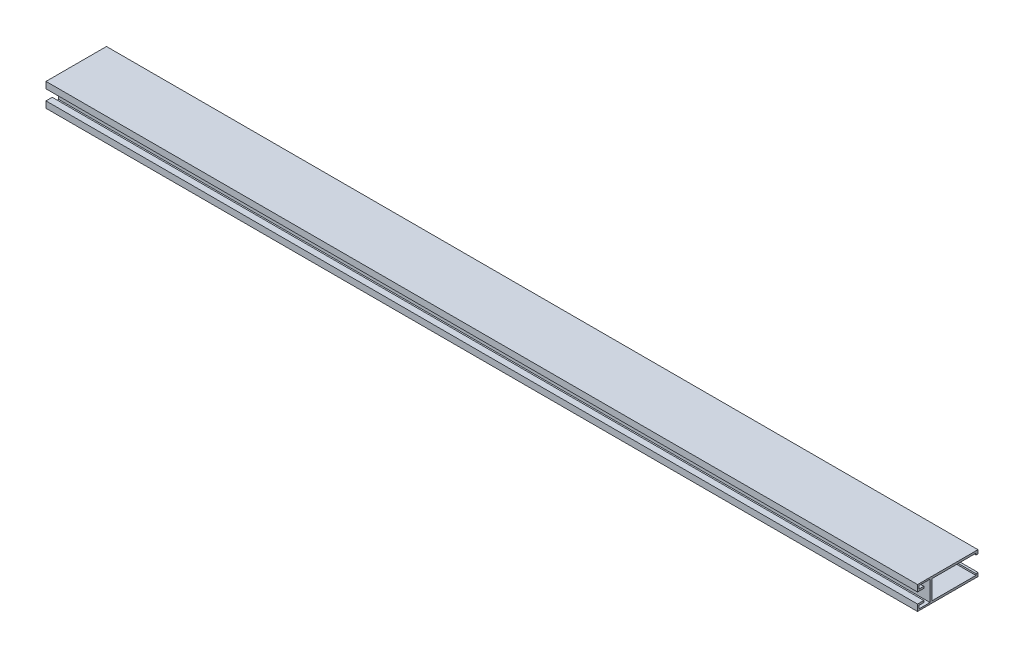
ISO-10303-21;
HEADER;
FILE_DESCRIPTION(('STEP AP214'),'2;1');
FILE_NAME('part.step','',(''),(''),'','','');
FILE_SCHEMA(('AUTOMOTIVE_DESIGN { 1 0 10303 214 1 1 1 1 }'));
ENDSEC;
DATA;
#1=APPLICATION_CONTEXT('core data for automotive mechanical design processes');
#2=APPLICATION_PROTOCOL_DEFINITION('international standard','automotive_design',2000,#1);
#3=PRODUCT_CONTEXT('',#1,'mechanical');
#4=PRODUCT('Part','Part','',(#3));
#5=PRODUCT_RELATED_PRODUCT_CATEGORY('part','',(#4));
#6=PRODUCT_DEFINITION_FORMATION('','',#4);
#7=PRODUCT_DEFINITION_CONTEXT('part definition',#1,'design');
#8=PRODUCT_DEFINITION('design','',#6,#7);
#9=PRODUCT_DEFINITION_SHAPE('','',#8);
#10=(LENGTH_UNIT() NAMED_UNIT(*) SI_UNIT(.MILLI.,.METRE.));
#11=(NAMED_UNIT(*) PLANE_ANGLE_UNIT() SI_UNIT($,.RADIAN.));
#12=(NAMED_UNIT(*) SI_UNIT($,.STERADIAN.) SOLID_ANGLE_UNIT());
#13=UNCERTAINTY_MEASURE_WITH_UNIT(LENGTH_MEASURE(1.E-05),#10,'distance_accuracy_value','');
#14=(GEOMETRIC_REPRESENTATION_CONTEXT(3) GLOBAL_UNCERTAINTY_ASSIGNED_CONTEXT((#13)) GLOBAL_UNIT_ASSIGNED_CONTEXT((#10,
#11,#12)) REPRESENTATION_CONTEXT('',''));
#15=CARTESIAN_POINT('',(0.,0.,0.));
#16=DIRECTION('',(0.,0.,1.));
#17=DIRECTION('',(1.,0.,0.));
#18=AXIS2_PLACEMENT_3D('',#15,#16,#17);
#19=CARTESIAN_POINT('',(903.,-11.55,14.));
#20=DIRECTION('',(0.,0.,1.));
#21=DIRECTION('',(1.,0.,0.));
#22=AXIS2_PLACEMENT_3D('',#19,#20,#21);
#23=PLANE('',#22);
#24=DIRECTION('',(0.,1.,0.));
#25=VECTOR('',#24,1.);
#26=CARTESIAN_POINT('',(903.,-11.55,14.));
#27=LINE('',#26,#25);
#28=CARTESIAN_POINT('',(903.,-10.8,14.));
#29=VERTEX_POINT('',#28);
#30=CARTESIAN_POINT('',(903.,-12.3,14.));
#31=VERTEX_POINT('',#30);
#32=EDGE_CURVE('E260',#29,#31,#27,.F.);
#33=ORIENTED_EDGE('',*,*,#32,.T.);
#34=DIRECTION('',(1.,0.,0.));
#35=VECTOR('',#34,1.);
#36=CARTESIAN_POINT('',(903.,-12.3,14.));
#37=LINE('',#36,#35);
#38=CARTESIAN_POINT('',(1739.,-12.3,14.));
#39=VERTEX_POINT('',#38);
#40=EDGE_CURVE('E252',#39,#31,#37,.F.);
#41=ORIENTED_EDGE('',*,*,#40,.F.);
#42=DIRECTION('',(0.,1.,0.));
#43=VECTOR('',#42,1.);
#44=CARTESIAN_POINT('',(1739.,-11.55,14.));
#45=LINE('',#44,#43);
#46=CARTESIAN_POINT('',(1739.,-10.8,14.));
#47=VERTEX_POINT('',#46);
#48=EDGE_CURVE('E20',#39,#47,#45,.T.);
#49=ORIENTED_EDGE('',*,*,#48,.T.);
#50=DIRECTION('',(1.,0.,0.));
#51=VECTOR('',#50,1.);
#52=CARTESIAN_POINT('',(903.,-10.8,14.));
#53=LINE('',#52,#51);
#54=EDGE_CURVE('E255',#29,#47,#53,.T.);
#55=ORIENTED_EDGE('',*,*,#54,.F.);
#56=EDGE_LOOP('',(#33,#41,#49,#55));
#57=FACE_BOUND('',#56,.T.);
#58=ADVANCED_FACE('F17',(#57),#23,.T.);
#59=CARTESIAN_POINT('',(903.,-28.45,14.));
#60=DIRECTION('',(0.,0.,1.));
#61=DIRECTION('',(1.,0.,0.));
#62=AXIS2_PLACEMENT_3D('',#59,#60,#61);
#63=PLANE('',#62);
#64=DIRECTION('',(0.,1.,0.));
#65=VECTOR('',#64,1.);
#66=CARTESIAN_POINT('',(903.,-28.45,14.));
#67=LINE('',#66,#65);
#68=CARTESIAN_POINT('',(903.,-27.7,14.));
#69=VERTEX_POINT('',#68);
#70=CARTESIAN_POINT('',(903.,-29.2,14.));
#71=VERTEX_POINT('',#70);
#72=EDGE_CURVE('E258',#69,#71,#67,.F.);
#73=ORIENTED_EDGE('',*,*,#72,.T.);
#74=DIRECTION('',(1.,0.,0.));
#75=VECTOR('',#74,1.);
#76=CARTESIAN_POINT('',(903.,-29.2,14.));
#77=LINE('',#76,#75);
#78=CARTESIAN_POINT('',(1739.,-29.2,14.));
#79=VERTEX_POINT('',#78);
#80=EDGE_CURVE('E192',#79,#71,#77,.F.);
#81=ORIENTED_EDGE('',*,*,#80,.F.);
#82=DIRECTION('',(0.,1.,0.));
#83=VECTOR('',#82,1.);
#84=CARTESIAN_POINT('',(1739.,-28.45,14.));
#85=LINE('',#84,#83);
#86=CARTESIAN_POINT('',(1739.,-27.7,14.));
#87=VERTEX_POINT('',#86);
#88=EDGE_CURVE('E175',#79,#87,#85,.T.);
#89=ORIENTED_EDGE('',*,*,#88,.T.);
#90=DIRECTION('',(1.,0.,0.));
#91=VECTOR('',#90,1.);
#92=CARTESIAN_POINT('',(903.,-27.7,14.));
#93=LINE('',#92,#91);
#94=EDGE_CURVE('E202',#69,#87,#93,.T.);
#95=ORIENTED_EDGE('',*,*,#94,.F.);
#96=EDGE_LOOP('',(#73,#81,#89,#95));
#97=FACE_BOUND('',#96,.T.);
#98=ADVANCED_FACE('F451',(#97),#63,.T.);
#99=CARTESIAN_POINT('',(903.,-10.8,35.));
#100=DIRECTION('',(0.,-1.,0.));
#101=DIRECTION('',(0.,0.,-1.));
#102=AXIS2_PLACEMENT_3D('',#99,#100,#101);
#103=PLANE('',#102);
#104=DIRECTION('',(0.,0.,-1.));
#105=VECTOR('',#104,1.);
#106=CARTESIAN_POINT('',(903.,-10.8,45.1641318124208));
#107=LINE('',#106,#105);
#108=CARTESIAN_POINT('',(903.,-10.8,56.));
#109=VERTEX_POINT('',#108);
#110=EDGE_CURVE('E270',#109,#29,#107,.T.);
#111=ORIENTED_EDGE('',*,*,#110,.T.);
#112=ORIENTED_EDGE('',*,*,#54,.T.);
#113=DIRECTION('',(0.,0.,-1.));
#114=VECTOR('',#113,1.);
#115=CARTESIAN_POINT('',(1739.,-10.8,45.1641318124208));
#116=LINE('',#115,#114);
#117=CARTESIAN_POINT('',(1739.,-10.8,56.));
#118=VERTEX_POINT('',#117);
#119=EDGE_CURVE('E199',#118,#47,#116,.T.);
#120=ORIENTED_EDGE('',*,*,#119,.F.);
#121=DIRECTION('',(-1.,0.,0.));
#122=VECTOR('',#121,1.);
#123=CARTESIAN_POINT('',(903.,-10.8,56.));
#124=LINE('',#123,#122);
#125=EDGE_CURVE('E191',#109,#118,#124,.F.);
#126=ORIENTED_EDGE('',*,*,#125,.F.);
#127=EDGE_LOOP('',(#111,#112,#120,#126));
#128=FACE_BOUND('',#127,.T.);
#129=ADVANCED_FACE('F268',(#128),#103,.T.);
#130=CARTESIAN_POINT('',(903.,-12.3,13.));
#131=DIRECTION('',(0.,-1.,0.));
#132=DIRECTION('',(0.,0.,-1.));
#133=AXIS2_PLACEMENT_3D('',#130,#131,#132);
#134=PLANE('',#133);
#135=DIRECTION('',(0.,0.,-1.));
#136=VECTOR('',#135,1.);
#137=CARTESIAN_POINT('',(903.,-12.3,45.1641318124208));
#138=LINE('',#137,#136);
#139=CARTESIAN_POINT('',(903.,-12.3,12.));
#140=VERTEX_POINT('',#139);
#141=EDGE_CURVE('E324',#31,#140,#138,.T.);
#142=ORIENTED_EDGE('',*,*,#141,.T.);
#143=DIRECTION('',(-1.,0.,0.));
#144=VECTOR('',#143,1.);
#145=CARTESIAN_POINT('',(903.,-12.3,12.));
#146=LINE('',#145,#144);
#147=CARTESIAN_POINT('',(1739.,-12.3,12.));
#148=VERTEX_POINT('',#147);
#149=EDGE_CURVE('E249',#148,#140,#146,.T.);
#150=ORIENTED_EDGE('',*,*,#149,.F.);
#151=DIRECTION('',(0.,0.,-1.));
#152=VECTOR('',#151,1.);
#153=CARTESIAN_POINT('',(1739.,-12.3,45.1641318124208));
#154=LINE('',#153,#152);
#155=EDGE_CURVE('E271',#39,#148,#154,.T.);
#156=ORIENTED_EDGE('',*,*,#155,.F.);
#157=ORIENTED_EDGE('',*,*,#40,.T.);
#158=EDGE_LOOP('',(#142,#150,#156,#157));
#159=FACE_BOUND('',#158,.T.);
#160=ADVANCED_FACE('F442',(#159),#134,.T.);
#161=CARTESIAN_POINT('',(903.,-10.55,12.));
#162=DIRECTION('',(0.,0.,-1.));
#163=DIRECTION('',(-1.,0.,0.));
#164=AXIS2_PLACEMENT_3D('',#161,#162,#163);
#165=PLANE('',#164);
#166=DIRECTION('',(0.,1.,0.));
#167=VECTOR('',#166,1.);
#168=CARTESIAN_POINT('',(903.,-20.,12.));
#169=LINE('',#168,#167);
#170=CARTESIAN_POINT('',(903.,-8.8,12.));
#171=VERTEX_POINT('',#170);
#172=EDGE_CURVE('E326',#140,#171,#169,.T.);
#173=ORIENTED_EDGE('',*,*,#172,.T.);
#174=DIRECTION('',(1.,0.,0.));
#175=VECTOR('',#174,1.);
#176=CARTESIAN_POINT('',(903.,-8.8,12.));
#177=LINE('',#176,#175);
#178=CARTESIAN_POINT('',(1739.,-8.8,12.));
#179=VERTEX_POINT('',#178);
#180=EDGE_CURVE('E246',#179,#171,#177,.F.);
#181=ORIENTED_EDGE('',*,*,#180,.F.);
#182=DIRECTION('',(0.,1.,0.));
#183=VECTOR('',#182,1.);
#184=CARTESIAN_POINT('',(1739.,-20.,12.));
#185=LINE('',#184,#183);
#186=EDGE_CURVE('E272',#148,#179,#185,.T.);
#187=ORIENTED_EDGE('',*,*,#186,.F.);
#188=ORIENTED_EDGE('',*,*,#149,.T.);
#189=EDGE_LOOP('',(#173,#181,#187,#188));
#190=FACE_BOUND('',#189,.T.);
#191=ADVANCED_FACE('F439',(#190),#165,.T.);
#192=CARTESIAN_POINT('',(903.,-8.8,41.));
#193=DIRECTION('',(0.,1.,0.));
#194=DIRECTION('',(0.,0.,1.));
#195=AXIS2_PLACEMENT_3D('',#192,#193,#194);
#196=PLANE('',#195);
#197=DIRECTION('',(0.,0.,-1.));
#198=VECTOR('',#197,1.);
#199=CARTESIAN_POINT('',(903.,-8.8,45.1641318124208));
#200=LINE('',#199,#198);
#201=CARTESIAN_POINT('',(903.,-8.8,70.));
#202=VERTEX_POINT('',#201);
#203=EDGE_CURVE('E328',#171,#202,#200,.F.);
#204=ORIENTED_EDGE('',*,*,#203,.T.);
#205=DIRECTION('',(1.,0.,0.));
#206=VECTOR('',#205,1.);
#207=CARTESIAN_POINT('',(903.,-8.8,70.));
#208=LINE('',#207,#206);
#209=CARTESIAN_POINT('',(1739.,-8.8,70.));
#210=VERTEX_POINT('',#209);
#211=EDGE_CURVE('E243',#210,#202,#208,.F.);
#212=ORIENTED_EDGE('',*,*,#211,.F.);
#213=DIRECTION('',(0.,0.,-1.));
#214=VECTOR('',#213,1.);
#215=CARTESIAN_POINT('',(1739.,-8.8,45.1641318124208));
#216=LINE('',#215,#214);
#217=EDGE_CURVE('E277',#179,#210,#216,.F.);
#218=ORIENTED_EDGE('',*,*,#217,.F.);
#219=ORIENTED_EDGE('',*,*,#180,.T.);
#220=EDGE_LOOP('',(#204,#212,#218,#219));
#221=FACE_BOUND('',#220,.T.);
#222=ADVANCED_FACE('F436',(#221),#196,.T.);
#223=CARTESIAN_POINT('',(903.,-11.9,70.));
#224=DIRECTION('',(0.,0.,1.));
#225=DIRECTION('',(1.,0.,0.));
#226=AXIS2_PLACEMENT_3D('',#223,#224,#225);
#227=PLANE('',#226);
#228=DIRECTION('',(0.,1.,0.));
#229=VECTOR('',#228,1.);
#230=CARTESIAN_POINT('',(903.,-20.,70.));
#231=LINE('',#230,#229);
#232=CARTESIAN_POINT('',(903.,-15.,70.));
#233=VERTEX_POINT('',#232);
#234=EDGE_CURVE('E330',#202,#233,#231,.F.);
#235=ORIENTED_EDGE('',*,*,#234,.T.);
#236=DIRECTION('',(1.,0.,0.));
#237=VECTOR('',#236,1.);
#238=CARTESIAN_POINT('',(903.,-15.,70.));
#239=LINE('',#238,#237);
#240=CARTESIAN_POINT('',(1739.,-15.,70.));
#241=VERTEX_POINT('',#240);
#242=EDGE_CURVE('E240',#241,#233,#239,.F.);
#243=ORIENTED_EDGE('',*,*,#242,.F.);
#244=DIRECTION('',(0.,1.,0.));
#245=VECTOR('',#244,1.);
#246=CARTESIAN_POINT('',(1739.,-20.,70.));
#247=LINE('',#246,#245);
#248=EDGE_CURVE('E280',#210,#241,#247,.F.);
#249=ORIENTED_EDGE('',*,*,#248,.F.);
#250=ORIENTED_EDGE('',*,*,#211,.T.);
#251=EDGE_LOOP('',(#235,#243,#249,#250));
#252=FACE_BOUND('',#251,.T.);
#253=ADVANCED_FACE('F432',(#252),#227,.T.);
#254=CARTESIAN_POINT('',(903.,-15.,67.));
#255=DIRECTION('',(0.,-1.,0.));
#256=DIRECTION('',(0.,0.,-1.));
#257=AXIS2_PLACEMENT_3D('',#254,#255,#256);
#258=PLANE('',#257);
#259=DIRECTION('',(0.,0.,-1.));
#260=VECTOR('',#259,1.);
#261=CARTESIAN_POINT('',(903.,-15.,45.1641318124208));
#262=LINE('',#261,#260);
#263=CARTESIAN_POINT('',(903.,-15.,64.));
#264=VERTEX_POINT('',#263);
#265=EDGE_CURVE('E332',#233,#264,#262,.T.);
#266=ORIENTED_EDGE('',*,*,#265,.T.);
#267=DIRECTION('',(-1.,0.,0.));
#268=VECTOR('',#267,1.);
#269=CARTESIAN_POINT('',(903.,-15.,64.));
#270=LINE('',#269,#268);
#271=CARTESIAN_POINT('',(1739.,-15.,64.));
#272=VERTEX_POINT('',#271);
#273=EDGE_CURVE('E237',#272,#264,#270,.T.);
#274=ORIENTED_EDGE('',*,*,#273,.F.);
#275=DIRECTION('',(0.,0.,-1.));
#276=VECTOR('',#275,1.);
#277=CARTESIAN_POINT('',(1739.,-15.,45.1641318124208));
#278=LINE('',#277,#276);
#279=EDGE_CURVE('E283',#241,#272,#278,.T.);
#280=ORIENTED_EDGE('',*,*,#279,.F.);
#281=ORIENTED_EDGE('',*,*,#242,.T.);
#282=EDGE_LOOP('',(#266,#274,#280,#281));
#283=FACE_BOUND('',#282,.T.);
#284=ADVANCED_FACE('F427',(#283),#258,.T.);
#285=CARTESIAN_POINT('',(903.,-14.1,64.));
#286=DIRECTION('',(0.,0.,-1.));
#287=DIRECTION('',(-1.,0.,0.));
#288=AXIS2_PLACEMENT_3D('',#285,#286,#287);
#289=PLANE('',#288);
#290=DIRECTION('',(0.,1.,0.));
#291=VECTOR('',#290,1.);
#292=CARTESIAN_POINT('',(903.,-20.,64.));
#293=LINE('',#292,#291);
#294=CARTESIAN_POINT('',(903.,-13.2,64.));
#295=VERTEX_POINT('',#294);
#296=EDGE_CURVE('E334',#264,#295,#293,.T.);
#297=ORIENTED_EDGE('',*,*,#296,.T.);
#298=DIRECTION('',(1.,0.,0.));
#299=VECTOR('',#298,1.);
#300=CARTESIAN_POINT('',(903.,-13.2,64.));
#301=LINE('',#300,#299);
#302=CARTESIAN_POINT('',(1739.,-13.2,64.));
#303=VERTEX_POINT('',#302);
#304=EDGE_CURVE('E234',#303,#295,#301,.F.);
#305=ORIENTED_EDGE('',*,*,#304,.F.);
#306=DIRECTION('',(0.,1.,0.));
#307=VECTOR('',#306,1.);
#308=CARTESIAN_POINT('',(1739.,-20.,64.));
#309=LINE('',#308,#307);
#310=EDGE_CURVE('E286',#272,#303,#309,.T.);
#311=ORIENTED_EDGE('',*,*,#310,.F.);
#312=ORIENTED_EDGE('',*,*,#273,.T.);
#313=EDGE_LOOP('',(#297,#305,#311,#312));
#314=FACE_BOUND('',#313,.T.);
#315=ADVANCED_FACE('F424',(#314),#289,.T.);
#316=CARTESIAN_POINT('',(903.,-13.2,66.25));
#317=DIRECTION('',(0.,1.,0.));
#318=DIRECTION('',(0.,0.,1.));
#319=AXIS2_PLACEMENT_3D('',#316,#317,#318);
#320=PLANE('',#319);
#321=DIRECTION('',(0.,0.,-1.));
#322=VECTOR('',#321,1.);
#323=CARTESIAN_POINT('',(903.,-13.2,45.1641318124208));
#324=LINE('',#323,#322);
#325=CARTESIAN_POINT('',(903.,-13.2,68.5));
#326=VERTEX_POINT('',#325);
#327=EDGE_CURVE('E336',#295,#326,#324,.F.);
#328=ORIENTED_EDGE('',*,*,#327,.T.);
#329=DIRECTION('',(-1.,0.,0.));
#330=VECTOR('',#329,1.);
#331=CARTESIAN_POINT('',(903.,-13.2,68.5));
#332=LINE('',#331,#330);
#333=CARTESIAN_POINT('',(1739.,-13.2,68.5));
#334=VERTEX_POINT('',#333);
#335=EDGE_CURVE('E231',#334,#326,#332,.T.);
#336=ORIENTED_EDGE('',*,*,#335,.F.);
#337=DIRECTION('',(0.,0.,-1.));
#338=VECTOR('',#337,1.);
#339=CARTESIAN_POINT('',(1739.,-13.2,45.1641318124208));
#340=LINE('',#339,#338);
#341=EDGE_CURVE('E289',#303,#334,#340,.F.);
#342=ORIENTED_EDGE('',*,*,#341,.F.);
#343=ORIENTED_EDGE('',*,*,#304,.T.);
#344=EDGE_LOOP('',(#328,#336,#342,#343));
#345=FACE_BOUND('',#344,.T.);
#346=ADVANCED_FACE('F420',(#345),#320,.T.);
#347=CARTESIAN_POINT('',(903.,-11.75,68.5));
#348=DIRECTION('',(0.,0.,-1.));
#349=DIRECTION('',(-1.,0.,0.));
#350=AXIS2_PLACEMENT_3D('',#347,#348,#349);
#351=PLANE('',#350);
#352=DIRECTION('',(0.,1.,0.));
#353=VECTOR('',#352,1.);
#354=CARTESIAN_POINT('',(903.,-20.,68.5));
#355=LINE('',#354,#353);
#356=CARTESIAN_POINT('',(903.,-10.3,68.5));
#357=VERTEX_POINT('',#356);
#358=EDGE_CURVE('E338',#326,#357,#355,.T.);
#359=ORIENTED_EDGE('',*,*,#358,.T.);
#360=DIRECTION('',(1.,0.,0.));
#361=VECTOR('',#360,1.);
#362=CARTESIAN_POINT('',(903.,-10.3,68.5));
#363=LINE('',#362,#361);
#364=CARTESIAN_POINT('',(1739.,-10.3,68.5));
#365=VERTEX_POINT('',#364);
#366=EDGE_CURVE('E228',#365,#357,#363,.F.);
#367=ORIENTED_EDGE('',*,*,#366,.F.);
#368=DIRECTION('',(0.,1.,0.));
#369=VECTOR('',#368,1.);
#370=CARTESIAN_POINT('',(1739.,-20.,68.5));
#371=LINE('',#370,#369);
#372=EDGE_CURVE('E292',#334,#365,#371,.T.);
#373=ORIENTED_EDGE('',*,*,#372,.F.);
#374=ORIENTED_EDGE('',*,*,#335,.T.);
#375=EDGE_LOOP('',(#359,#367,#373,#374));
#376=FACE_BOUND('',#375,.T.);
#377=ADVANCED_FACE('F415',(#376),#351,.T.);
#378=CARTESIAN_POINT('',(903.,-10.3,63.25));
#379=DIRECTION('',(0.,-1.,0.));
#380=DIRECTION('',(0.,0.,-1.));
#381=AXIS2_PLACEMENT_3D('',#378,#379,#380);
#382=PLANE('',#381);
#383=DIRECTION('',(0.,0.,-1.));
#384=VECTOR('',#383,1.);
#385=CARTESIAN_POINT('',(903.,-10.3,45.1641318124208));
#386=LINE('',#385,#384);
#387=CARTESIAN_POINT('',(903.,-10.3,58.));
#388=VERTEX_POINT('',#387);
#389=EDGE_CURVE('E340',#357,#388,#386,.T.);
#390=ORIENTED_EDGE('',*,*,#389,.T.);
#391=DIRECTION('',(1.,0.,0.));
#392=VECTOR('',#391,1.);
#393=CARTESIAN_POINT('',(903.,-10.3,58.));
#394=LINE('',#393,#392);
#395=CARTESIAN_POINT('',(1739.,-10.3,58.));
#396=VERTEX_POINT('',#395);
#397=EDGE_CURVE('E225',#396,#388,#394,.F.);
#398=ORIENTED_EDGE('',*,*,#397,.F.);
#399=DIRECTION('',(0.,0.,-1.));
#400=VECTOR('',#399,1.);
#401=CARTESIAN_POINT('',(1739.,-10.3,45.1641318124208));
#402=LINE('',#401,#400);
#403=EDGE_CURVE('E295',#365,#396,#402,.T.);
#404=ORIENTED_EDGE('',*,*,#403,.F.);
#405=ORIENTED_EDGE('',*,*,#366,.T.);
#406=EDGE_LOOP('',(#390,#398,#404,#405));
#407=FACE_BOUND('',#406,.T.);
#408=ADVANCED_FACE('F412',(#407),#382,.T.);
#409=CARTESIAN_POINT('',(903.,-20.,58.));
#410=DIRECTION('',(0.,0.,1.));
#411=DIRECTION('',(1.,0.,0.));
#412=AXIS2_PLACEMENT_3D('',#409,#410,#411);
#413=PLANE('',#412);
#414=DIRECTION('',(0.,1.,0.));
#415=VECTOR('',#414,1.);
#416=CARTESIAN_POINT('',(903.,-20.,58.));
#417=LINE('',#416,#415);
#418=CARTESIAN_POINT('',(903.,-29.7,58.));
#419=VERTEX_POINT('',#418);
#420=EDGE_CURVE('E342',#388,#419,#417,.F.);
#421=ORIENTED_EDGE('',*,*,#420,.T.);
#422=DIRECTION('',(1.,0.,0.));
#423=VECTOR('',#422,1.);
#424=CARTESIAN_POINT('',(903.,-29.7,58.));
#425=LINE('',#424,#423);
#426=CARTESIAN_POINT('',(1739.,-29.7,58.));
#427=VERTEX_POINT('',#426);
#428=EDGE_CURVE('E222',#427,#419,#425,.F.);
#429=ORIENTED_EDGE('',*,*,#428,.F.);
#430=DIRECTION('',(0.,1.,0.));
#431=VECTOR('',#430,1.);
#432=CARTESIAN_POINT('',(1739.,-20.,58.));
#433=LINE('',#432,#431);
#434=EDGE_CURVE('E298',#396,#427,#433,.F.);
#435=ORIENTED_EDGE('',*,*,#434,.F.);
#436=ORIENTED_EDGE('',*,*,#397,.T.);
#437=EDGE_LOOP('',(#421,#429,#435,#436));
#438=FACE_BOUND('',#437,.T.);
#439=ADVANCED_FACE('F408',(#438),#413,.T.);
#440=CARTESIAN_POINT('',(903.,-29.7,63.25));
#441=DIRECTION('',(0.,1.,0.));
#442=DIRECTION('',(0.,0.,1.));
#443=AXIS2_PLACEMENT_3D('',#440,#441,#442);
#444=PLANE('',#443);
#445=DIRECTION('',(0.,0.,-1.));
#446=VECTOR('',#445,1.);
#447=CARTESIAN_POINT('',(903.,-29.7,45.1641318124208));
#448=LINE('',#447,#446);
#449=CARTESIAN_POINT('',(903.,-29.7,68.5));
#450=VERTEX_POINT('',#449);
#451=EDGE_CURVE('E344',#419,#450,#448,.F.);
#452=ORIENTED_EDGE('',*,*,#451,.T.);
#453=DIRECTION('',(-1.,0.,0.));
#454=VECTOR('',#453,1.);
#455=CARTESIAN_POINT('',(903.,-29.7,68.5));
#456=LINE('',#455,#454);
#457=CARTESIAN_POINT('',(1739.,-29.7,68.5));
#458=VERTEX_POINT('',#457);
#459=EDGE_CURVE('E219',#458,#450,#456,.T.);
#460=ORIENTED_EDGE('',*,*,#459,.F.);
#461=DIRECTION('',(0.,0.,-1.));
#462=VECTOR('',#461,1.);
#463=CARTESIAN_POINT('',(1739.,-29.7,45.1641318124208));
#464=LINE('',#463,#462);
#465=EDGE_CURVE('E301',#427,#458,#464,.F.);
#466=ORIENTED_EDGE('',*,*,#465,.F.);
#467=ORIENTED_EDGE('',*,*,#428,.T.);
#468=EDGE_LOOP('',(#452,#460,#466,#467));
#469=FACE_BOUND('',#468,.T.);
#470=ADVANCED_FACE('F403',(#469),#444,.T.);
#471=CARTESIAN_POINT('',(903.,-28.25,68.5));
#472=DIRECTION('',(0.,0.,-1.));
#473=DIRECTION('',(-1.,0.,0.));
#474=AXIS2_PLACEMENT_3D('',#471,#472,#473);
#475=PLANE('',#474);
#476=DIRECTION('',(0.,1.,0.));
#477=VECTOR('',#476,1.);
#478=CARTESIAN_POINT('',(903.,-20.,68.5));
#479=LINE('',#478,#477);
#480=CARTESIAN_POINT('',(903.,-26.8,68.5));
#481=VERTEX_POINT('',#480);
#482=EDGE_CURVE('E346',#450,#481,#479,.T.);
#483=ORIENTED_EDGE('',*,*,#482,.T.);
#484=DIRECTION('',(1.,0.,0.));
#485=VECTOR('',#484,1.);
#486=CARTESIAN_POINT('',(903.,-26.8,68.5));
#487=LINE('',#486,#485);
#488=CARTESIAN_POINT('',(1739.,-26.8,68.5));
#489=VERTEX_POINT('',#488);
#490=EDGE_CURVE('E216',#489,#481,#487,.F.);
#491=ORIENTED_EDGE('',*,*,#490,.F.);
#492=DIRECTION('',(0.,1.,0.));
#493=VECTOR('',#492,1.);
#494=CARTESIAN_POINT('',(1739.,-20.,68.5));
#495=LINE('',#494,#493);
#496=EDGE_CURVE('E304',#458,#489,#495,.T.);
#497=ORIENTED_EDGE('',*,*,#496,.F.);
#498=ORIENTED_EDGE('',*,*,#459,.T.);
#499=EDGE_LOOP('',(#483,#491,#497,#498));
#500=FACE_BOUND('',#499,.T.);
#501=ADVANCED_FACE('F400',(#500),#475,.T.);
#502=CARTESIAN_POINT('',(903.,-26.8,66.25));
#503=DIRECTION('',(0.,-1.,0.));
#504=DIRECTION('',(0.,0.,-1.));
#505=AXIS2_PLACEMENT_3D('',#502,#503,#504);
#506=PLANE('',#505);
#507=DIRECTION('',(0.,0.,-1.));
#508=VECTOR('',#507,1.);
#509=CARTESIAN_POINT('',(903.,-26.8,45.1641318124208));
#510=LINE('',#509,#508);
#511=CARTESIAN_POINT('',(903.,-26.8,64.));
#512=VERTEX_POINT('',#511);
#513=EDGE_CURVE('E348',#481,#512,#510,.T.);
#514=ORIENTED_EDGE('',*,*,#513,.T.);
#515=DIRECTION('',(-1.,0.,0.));
#516=VECTOR('',#515,1.);
#517=CARTESIAN_POINT('',(903.,-26.8,64.));
#518=LINE('',#517,#516);
#519=CARTESIAN_POINT('',(1739.,-26.8,64.));
#520=VERTEX_POINT('',#519);
#521=EDGE_CURVE('E213',#520,#512,#518,.T.);
#522=ORIENTED_EDGE('',*,*,#521,.F.);
#523=DIRECTION('',(0.,0.,-1.));
#524=VECTOR('',#523,1.);
#525=CARTESIAN_POINT('',(1739.,-26.8,45.1641318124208));
#526=LINE('',#525,#524);
#527=EDGE_CURVE('E307',#489,#520,#526,.T.);
#528=ORIENTED_EDGE('',*,*,#527,.F.);
#529=ORIENTED_EDGE('',*,*,#490,.T.);
#530=EDGE_LOOP('',(#514,#522,#528,#529));
#531=FACE_BOUND('',#530,.T.);
#532=ADVANCED_FACE('F396',(#531),#506,.T.);
#533=CARTESIAN_POINT('',(903.,-25.9,64.));
#534=DIRECTION('',(0.,0.,-1.));
#535=DIRECTION('',(-1.,0.,0.));
#536=AXIS2_PLACEMENT_3D('',#533,#534,#535);
#537=PLANE('',#536);
#538=DIRECTION('',(0.,1.,0.));
#539=VECTOR('',#538,1.);
#540=CARTESIAN_POINT('',(903.,-20.,64.));
#541=LINE('',#540,#539);
#542=CARTESIAN_POINT('',(903.,-25.,64.));
#543=VERTEX_POINT('',#542);
#544=EDGE_CURVE('E350',#512,#543,#541,.T.);
#545=ORIENTED_EDGE('',*,*,#544,.T.);
#546=DIRECTION('',(1.,0.,0.));
#547=VECTOR('',#546,1.);
#548=CARTESIAN_POINT('',(903.,-25.,64.));
#549=LINE('',#548,#547);
#550=CARTESIAN_POINT('',(1739.,-25.,64.));
#551=VERTEX_POINT('',#550);
#552=EDGE_CURVE('E210',#551,#543,#549,.F.);
#553=ORIENTED_EDGE('',*,*,#552,.F.);
#554=DIRECTION('',(0.,1.,0.));
#555=VECTOR('',#554,1.);
#556=CARTESIAN_POINT('',(1739.,-20.,64.));
#557=LINE('',#556,#555);
#558=EDGE_CURVE('E310',#520,#551,#557,.T.);
#559=ORIENTED_EDGE('',*,*,#558,.F.);
#560=ORIENTED_EDGE('',*,*,#521,.T.);
#561=EDGE_LOOP('',(#545,#553,#559,#560));
#562=FACE_BOUND('',#561,.T.);
#563=ADVANCED_FACE('F391',(#562),#537,.T.);
#564=CARTESIAN_POINT('',(903.,-25.,67.));
#565=DIRECTION('',(0.,1.,0.));
#566=DIRECTION('',(0.,0.,1.));
#567=AXIS2_PLACEMENT_3D('',#564,#565,#566);
#568=PLANE('',#567);
#569=DIRECTION('',(0.,0.,-1.));
#570=VECTOR('',#569,1.);
#571=CARTESIAN_POINT('',(903.,-25.,45.1641318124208));
#572=LINE('',#571,#570);
#573=CARTESIAN_POINT('',(903.,-25.,70.));
#574=VERTEX_POINT('',#573);
#575=EDGE_CURVE('E352',#543,#574,#572,.F.);
#576=ORIENTED_EDGE('',*,*,#575,.T.);
#577=DIRECTION('',(1.,0.,0.));
#578=VECTOR('',#577,1.);
#579=CARTESIAN_POINT('',(903.,-25.,70.));
#580=LINE('',#579,#578);
#581=CARTESIAN_POINT('',(1739.,-25.,70.));
#582=VERTEX_POINT('',#581);
#583=EDGE_CURVE('E320',#582,#574,#580,.F.);
#584=ORIENTED_EDGE('',*,*,#583,.F.);
#585=DIRECTION('',(0.,0.,-1.));
#586=VECTOR('',#585,1.);
#587=CARTESIAN_POINT('',(1739.,-25.,45.1641318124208));
#588=LINE('',#587,#586);
#589=EDGE_CURVE('E313',#551,#582,#588,.F.);
#590=ORIENTED_EDGE('',*,*,#589,.F.);
#591=ORIENTED_EDGE('',*,*,#552,.T.);
#592=EDGE_LOOP('',(#576,#584,#590,#591));
#593=FACE_BOUND('',#592,.T.);
#594=ADVANCED_FACE('F388',(#593),#568,.T.);
#595=CARTESIAN_POINT('',(903.,-29.2,35.));
#596=DIRECTION('',(0.,1.,0.));
#597=DIRECTION('',(0.,0.,1.));
#598=AXIS2_PLACEMENT_3D('',#595,#596,#597);
#599=PLANE('',#598);
#600=DIRECTION('',(0.,0.,-1.));
#601=VECTOR('',#600,1.);
#602=CARTESIAN_POINT('',(903.,-29.2,45.1641318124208));
#603=LINE('',#602,#601);
#604=CARTESIAN_POINT('',(903.,-29.2,56.));
#605=VERTEX_POINT('',#604);
#606=EDGE_CURVE('E187',#71,#605,#603,.F.);
#607=ORIENTED_EDGE('',*,*,#606,.T.);
#608=DIRECTION('',(-1.,0.,0.));
#609=VECTOR('',#608,1.);
#610=CARTESIAN_POINT('',(903.,-29.2,56.));
#611=LINE('',#610,#609);
#612=CARTESIAN_POINT('',(1739.,-29.2,56.));
#613=VERTEX_POINT('',#612);
#614=EDGE_CURVE('E181',#613,#605,#611,.T.);
#615=ORIENTED_EDGE('',*,*,#614,.F.);
#616=DIRECTION('',(0.,0.,-1.));
#617=VECTOR('',#616,1.);
#618=CARTESIAN_POINT('',(1739.,-29.2,45.1641318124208));
#619=LINE('',#618,#617);
#620=EDGE_CURVE('E185',#79,#613,#619,.F.);
#621=ORIENTED_EDGE('',*,*,#620,.F.);
#622=ORIENTED_EDGE('',*,*,#80,.T.);
#623=EDGE_LOOP('',(#607,#615,#621,#622));
#624=FACE_BOUND('',#623,.T.);
#625=ADVANCED_FACE('F183',(#624),#599,.T.);
#626=CARTESIAN_POINT('',(903.,-20.,56.));
#627=DIRECTION('',(0.,0.,-1.));
#628=DIRECTION('',(-1.,0.,0.));
#629=AXIS2_PLACEMENT_3D('',#626,#627,#628);
#630=PLANE('',#629);
#631=DIRECTION('',(0.,1.,0.));
#632=VECTOR('',#631,1.);
#633=CARTESIAN_POINT('',(903.,-20.,56.));
#634=LINE('',#633,#632);
#635=EDGE_CURVE('E360',#605,#109,#634,.T.);
#636=ORIENTED_EDGE('',*,*,#635,.T.);
#637=ORIENTED_EDGE('',*,*,#125,.T.);
#638=DIRECTION('',(0.,1.,0.));
#639=VECTOR('',#638,1.);
#640=CARTESIAN_POINT('',(1739.,-20.,56.));
#641=LINE('',#640,#639);
#642=EDGE_CURVE('E195',#613,#118,#641,.T.);
#643=ORIENTED_EDGE('',*,*,#642,.F.);
#644=ORIENTED_EDGE('',*,*,#614,.T.);
#645=EDGE_LOOP('',(#636,#637,#643,#644));
#646=FACE_BOUND('',#645,.T.);
#647=ADVANCED_FACE('F196',(#646),#630,.T.);
#648=CARTESIAN_POINT('',(903.,-27.7,13.));
#649=DIRECTION('',(0.,1.,0.));
#650=DIRECTION('',(0.,0.,1.));
#651=AXIS2_PLACEMENT_3D('',#648,#649,#650);
#652=PLANE('',#651);
#653=DIRECTION('',(0.,0.,-1.));
#654=VECTOR('',#653,1.);
#655=CARTESIAN_POINT('',(903.,-27.7,45.1641318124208));
#656=LINE('',#655,#654);
#657=CARTESIAN_POINT('',(903.,-27.7,12.));
#658=VERTEX_POINT('',#657);
#659=EDGE_CURVE('E356',#658,#69,#656,.F.);
#660=ORIENTED_EDGE('',*,*,#659,.T.);
#661=ORIENTED_EDGE('',*,*,#94,.T.);
#662=DIRECTION('',(0.,0.,-1.));
#663=VECTOR('',#662,1.);
#664=CARTESIAN_POINT('',(1739.,-27.7,45.1641318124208));
#665=LINE('',#664,#663);
#666=CARTESIAN_POINT('',(1739.,-27.7,12.));
#667=VERTEX_POINT('',#666);
#668=EDGE_CURVE('E315',#667,#87,#665,.F.);
#669=ORIENTED_EDGE('',*,*,#668,.F.);
#670=DIRECTION('',(-1.,0.,0.));
#671=VECTOR('',#670,1.);
#672=CARTESIAN_POINT('',(903.,-27.7,12.));
#673=LINE('',#672,#671);
#674=EDGE_CURVE('E366',#658,#667,#673,.F.);
#675=ORIENTED_EDGE('',*,*,#674,.F.);
#676=EDGE_LOOP('',(#660,#661,#669,#675));
#677=FACE_BOUND('',#676,.T.);
#678=ADVANCED_FACE('F448',(#677),#652,.T.);
#679=CARTESIAN_POINT('',(1739.,-20.,45.1641318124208));
#680=DIRECTION('',(1.,0.,0.));
#681=DIRECTION('',(0.,0.,-1.));
#682=AXIS2_PLACEMENT_3D('',#679,#680,#681);
#683=PLANE('',#682);
#684=ORIENTED_EDGE('',*,*,#668,.T.);
#685=ORIENTED_EDGE('',*,*,#88,.F.);
#686=ORIENTED_EDGE('',*,*,#620,.T.);
#687=ORIENTED_EDGE('',*,*,#642,.T.);
#688=ORIENTED_EDGE('',*,*,#119,.T.);
#689=ORIENTED_EDGE('',*,*,#48,.F.);
#690=ORIENTED_EDGE('',*,*,#155,.T.);
#691=ORIENTED_EDGE('',*,*,#186,.T.);
#692=ORIENTED_EDGE('',*,*,#217,.T.);
#693=ORIENTED_EDGE('',*,*,#248,.T.);
#694=ORIENTED_EDGE('',*,*,#279,.T.);
#695=ORIENTED_EDGE('',*,*,#310,.T.);
#696=ORIENTED_EDGE('',*,*,#341,.T.);
#697=ORIENTED_EDGE('',*,*,#372,.T.);
#698=ORIENTED_EDGE('',*,*,#403,.T.);
#699=ORIENTED_EDGE('',*,*,#434,.T.);
#700=ORIENTED_EDGE('',*,*,#465,.T.);
#701=ORIENTED_EDGE('',*,*,#496,.T.);
#702=ORIENTED_EDGE('',*,*,#527,.T.);
#703=ORIENTED_EDGE('',*,*,#558,.T.);
#704=ORIENTED_EDGE('',*,*,#589,.T.);
#705=DIRECTION('',(0.,1.,0.));
#706=VECTOR('',#705,1.);
#707=CARTESIAN_POINT('',(1739.,-28.1,70.));
#708=LINE('',#707,#706);
#709=CARTESIAN_POINT('',(1739.,-31.2,70.));
#710=VERTEX_POINT('',#709);
#711=EDGE_CURVE('E317',#710,#582,#708,.T.);
#712=ORIENTED_EDGE('',*,*,#711,.F.);
#713=DIRECTION('',(0.,0.,-1.));
#714=VECTOR('',#713,1.);
#715=CARTESIAN_POINT('',(1739.,-31.2,41.));
#716=LINE('',#715,#714);
#717=CARTESIAN_POINT('',(1739.,-31.2,12.));
#718=VERTEX_POINT('',#717);
#719=EDGE_CURVE('E369',#718,#710,#716,.F.);
#720=ORIENTED_EDGE('',*,*,#719,.F.);
#721=DIRECTION('',(0.,1.,0.));
#722=VECTOR('',#721,1.);
#723=CARTESIAN_POINT('',(1739.,-29.45,12.));
#724=LINE('',#723,#722);
#725=EDGE_CURVE('E362',#667,#718,#724,.F.);
#726=ORIENTED_EDGE('',*,*,#725,.F.);
#727=EDGE_LOOP('',(#684,#685,#686,#687,#688,#689,#690,#691,#692,#693,#694,#695,#696,#697,#698,
#699,#700,#701,#702,#703,#704,#712,#720,#726));
#728=FACE_BOUND('',#727,.T.);
#729=ADVANCED_FACE('F201',(#728),#683,.T.);
#730=CARTESIAN_POINT('',(903.,-28.1,70.));
#731=DIRECTION('',(0.,0.,1.));
#732=DIRECTION('',(1.,0.,0.));
#733=AXIS2_PLACEMENT_3D('',#730,#731,#732);
#734=PLANE('',#733);
#735=DIRECTION('',(0.,1.,0.));
#736=VECTOR('',#735,1.);
#737=CARTESIAN_POINT('',(903.,-20.,70.));
#738=LINE('',#737,#736);
#739=CARTESIAN_POINT('',(903.,-31.2,70.));
#740=VERTEX_POINT('',#739);
#741=EDGE_CURVE('E354',#574,#740,#738,.F.);
#742=ORIENTED_EDGE('',*,*,#741,.T.);
#743=DIRECTION('',(1.,0.,0.));
#744=VECTOR('',#743,1.);
#745=CARTESIAN_POINT('',(903.,-31.2,70.));
#746=LINE('',#745,#744);
#747=EDGE_CURVE('E372',#710,#740,#746,.F.);
#748=ORIENTED_EDGE('',*,*,#747,.F.);
#749=ORIENTED_EDGE('',*,*,#711,.T.);
#750=ORIENTED_EDGE('',*,*,#583,.T.);
#751=EDGE_LOOP('',(#742,#748,#749,#750));
#752=FACE_BOUND('',#751,.T.);
#753=ADVANCED_FACE('F384',(#752),#734,.T.);
#754=CARTESIAN_POINT('',(903.,-20.,45.1641318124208));
#755=DIRECTION('',(1.,0.,0.));
#756=DIRECTION('',(0.,0.,-1.));
#757=AXIS2_PLACEMENT_3D('',#754,#755,#756);
#758=PLANE('',#757);
#759=ORIENTED_EDGE('',*,*,#606,.F.);
#760=ORIENTED_EDGE('',*,*,#72,.F.);
#761=ORIENTED_EDGE('',*,*,#659,.F.);
#762=DIRECTION('',(0.,1.,0.));
#763=VECTOR('',#762,1.);
#764=CARTESIAN_POINT('',(903.,-29.45,12.));
#765=LINE('',#764,#763);
#766=CARTESIAN_POINT('',(903.,-31.2,12.));
#767=VERTEX_POINT('',#766);
#768=EDGE_CURVE('E35',#767,#658,#765,.T.);
#769=ORIENTED_EDGE('',*,*,#768,.F.);
#770=DIRECTION('',(0.,0.,-1.));
#771=VECTOR('',#770,1.);
#772=CARTESIAN_POINT('',(903.,-31.2,41.));
#773=LINE('',#772,#771);
#774=EDGE_CURVE('E26',#740,#767,#773,.T.);
#775=ORIENTED_EDGE('',*,*,#774,.F.);
#776=ORIENTED_EDGE('',*,*,#741,.F.);
#777=ORIENTED_EDGE('',*,*,#575,.F.);
#778=ORIENTED_EDGE('',*,*,#544,.F.);
#779=ORIENTED_EDGE('',*,*,#513,.F.);
#780=ORIENTED_EDGE('',*,*,#482,.F.);
#781=ORIENTED_EDGE('',*,*,#451,.F.);
#782=ORIENTED_EDGE('',*,*,#420,.F.);
#783=ORIENTED_EDGE('',*,*,#389,.F.);
#784=ORIENTED_EDGE('',*,*,#358,.F.);
#785=ORIENTED_EDGE('',*,*,#327,.F.);
#786=ORIENTED_EDGE('',*,*,#296,.F.);
#787=ORIENTED_EDGE('',*,*,#265,.F.);
#788=ORIENTED_EDGE('',*,*,#234,.F.);
#789=ORIENTED_EDGE('',*,*,#203,.F.);
#790=ORIENTED_EDGE('',*,*,#172,.F.);
#791=ORIENTED_EDGE('',*,*,#141,.F.);
#792=ORIENTED_EDGE('',*,*,#32,.F.);
#793=ORIENTED_EDGE('',*,*,#110,.F.);
#794=ORIENTED_EDGE('',*,*,#635,.F.);
#795=EDGE_LOOP('',(#759,#760,#761,#769,#775,#776,#777,#778,#779,#780,#781,#782,#783,#784,#785,
#786,#787,#788,#789,#790,#791,#792,#793,#794));
#796=FACE_BOUND('',#795,.T.);
#797=ADVANCED_FACE('F380',(#796),#758,.F.);
#798=CARTESIAN_POINT('',(903.,-29.45,12.));
#799=DIRECTION('',(0.,0.,-1.));
#800=DIRECTION('',(-1.,0.,0.));
#801=AXIS2_PLACEMENT_3D('',#798,#799,#800);
#802=PLANE('',#801);
#803=ORIENTED_EDGE('',*,*,#768,.T.);
#804=ORIENTED_EDGE('',*,*,#674,.T.);
#805=ORIENTED_EDGE('',*,*,#725,.T.);
#806=DIRECTION('',(1.,0.,0.));
#807=VECTOR('',#806,1.);
#808=CARTESIAN_POINT('',(903.,-31.2,12.));
#809=LINE('',#808,#807);
#810=EDGE_CURVE('E11',#767,#718,#809,.T.);
#811=ORIENTED_EDGE('',*,*,#810,.F.);
#812=EDGE_LOOP('',(#803,#804,#805,#811));
#813=FACE_BOUND('',#812,.T.);
#814=ADVANCED_FACE('F445',(#813),#802,.T.);
#815=CARTESIAN_POINT('',(903.,-31.2,41.));
#816=DIRECTION('',(0.,-1.,0.));
#817=DIRECTION('',(0.,0.,-1.));
#818=AXIS2_PLACEMENT_3D('',#815,#816,#817);
#819=PLANE('',#818);
#820=ORIENTED_EDGE('',*,*,#774,.T.);
#821=ORIENTED_EDGE('',*,*,#810,.T.);
#822=ORIENTED_EDGE('',*,*,#719,.T.);
#823=ORIENTED_EDGE('',*,*,#747,.T.);
#824=EDGE_LOOP('',(#820,#821,#822,#823));
#825=FACE_BOUND('',#824,.T.);
#826=ADVANCED_FACE('F377',(#825),#819,.T.);
#827=CLOSED_SHELL('',(#58,#98,#129,#160,#191,#222,#253,#284,#315,#346,#377,#408,#439,#470,#501,
#532,#563,#594,#625,#647,#678,#729,#753,#797,#814,#826));
#828=MANIFOLD_SOLID_BREP('B1',#827);
#829=ADVANCED_BREP_SHAPE_REPRESENTATION('',(#18,#828),#14);
#830=SHAPE_DEFINITION_REPRESENTATION(#9,#829);
ENDSEC;
END-ISO-10303-21;
